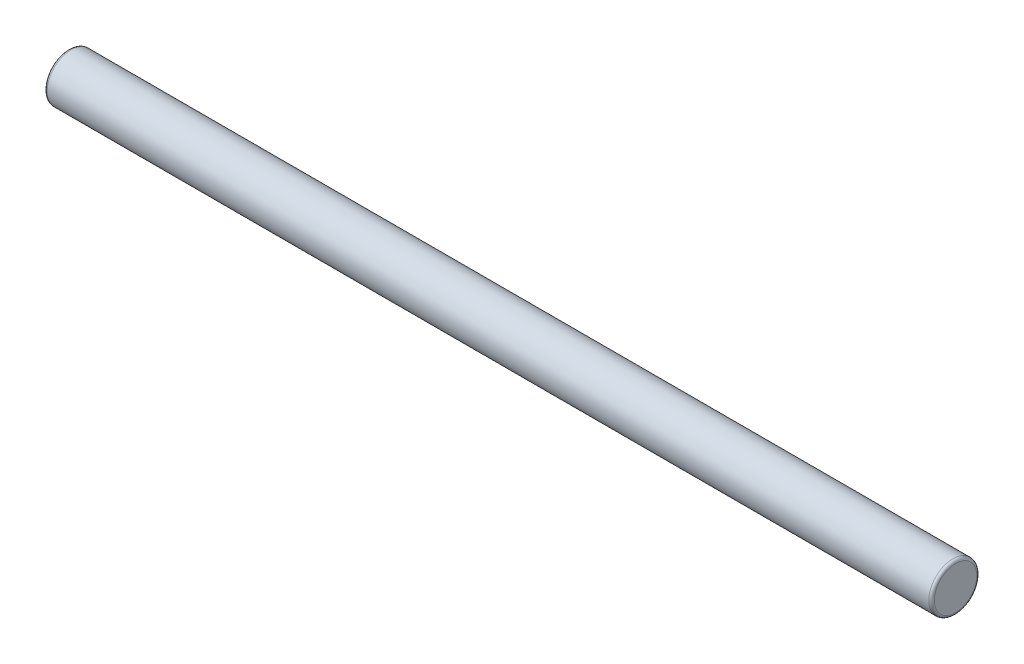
ISO-10303-21;
HEADER;
FILE_DESCRIPTION(('STEP AP214'),'2;1');
FILE_NAME('part.step','',(''),(''),'','','');
FILE_SCHEMA(('AUTOMOTIVE_DESIGN { 1 0 10303 214 1 1 1 1 }'));
ENDSEC;
DATA;
#1=APPLICATION_CONTEXT('core data for automotive mechanical design processes');
#2=APPLICATION_PROTOCOL_DEFINITION('international standard','automotive_design',2000,#1);
#3=PRODUCT_CONTEXT('',#1,'mechanical');
#4=PRODUCT('Part','Part','',(#3));
#5=PRODUCT_RELATED_PRODUCT_CATEGORY('part','',(#4));
#6=PRODUCT_DEFINITION_FORMATION('','',#4);
#7=PRODUCT_DEFINITION_CONTEXT('part definition',#1,'design');
#8=PRODUCT_DEFINITION('design','',#6,#7);
#9=PRODUCT_DEFINITION_SHAPE('','',#8);
#10=(LENGTH_UNIT() NAMED_UNIT(*) SI_UNIT(.MILLI.,.METRE.));
#11=(NAMED_UNIT(*) PLANE_ANGLE_UNIT() SI_UNIT($,.RADIAN.));
#12=(NAMED_UNIT(*) SI_UNIT($,.STERADIAN.) SOLID_ANGLE_UNIT());
#13=UNCERTAINTY_MEASURE_WITH_UNIT(LENGTH_MEASURE(1.E-05),#10,'distance_accuracy_value','');
#14=(GEOMETRIC_REPRESENTATION_CONTEXT(3) GLOBAL_UNCERTAINTY_ASSIGNED_CONTEXT((#13)) GLOBAL_UNIT_ASSIGNED_CONTEXT((#10,
#11,#12)) REPRESENTATION_CONTEXT('',''));
#15=CARTESIAN_POINT('',(0.,0.,0.));
#16=DIRECTION('',(0.,0.,1.));
#17=DIRECTION('',(1.,0.,0.));
#18=AXIS2_PLACEMENT_3D('',#15,#16,#17);
#19=CARTESIAN_POINT('',(-323.,0.,0.));
#20=DIRECTION('',(1.,0.,0.));
#21=DIRECTION('',(0.,1.,0.));
#22=AXIS2_PLACEMENT_3D('',#19,#20,#21);
#23=PLANE('',#22);
#24=CARTESIAN_POINT('',(-323.,0.,0.));
#25=DIRECTION('',(1.,0.,0.));
#26=DIRECTION('',(0.,1.,0.));
#27=AXIS2_PLACEMENT_3D('',#24,#25,#26);
#28=CIRCLE('',#27,15.5);
#29=CARTESIAN_POINT('',(-323.,15.5,0.));
#30=VERTEX_POINT('',#29);
#31=EDGE_CURVE('E55',#30,#30,#28,.F.);
#32=ORIENTED_EDGE('',*,*,#31,.T.);
#33=EDGE_LOOP('',(#32));
#34=FACE_BOUND('',#33,.T.);
#35=ADVANCED_FACE('F37',(#34),#23,.F.);
#36=CARTESIAN_POINT('',(-323.,0.,0.));
#37=DIRECTION('',(-1.,0.,0.));
#38=DIRECTION('',(0.,-1.,0.));
#39=AXIS2_PLACEMENT_3D('',#36,#37,#38);
#40=CYLINDRICAL_SURFACE('',#39,17.5);
#41=CARTESIAN_POINT('',(-321.,0.,0.));
#42=DIRECTION('',(1.,0.,0.));
#43=DIRECTION('',(0.,1.,0.));
#44=AXIS2_PLACEMENT_3D('',#41,#42,#43);
#45=CIRCLE('',#44,17.5);
#46=CARTESIAN_POINT('',(-321.,17.5,0.));
#47=VERTEX_POINT('',#46);
#48=EDGE_CURVE('E45',#47,#47,#45,.T.);
#49=ORIENTED_EDGE('',*,*,#48,.T.);
#50=EDGE_LOOP('',(#49));
#51=FACE_BOUND('',#50,.T.);
#52=CARTESIAN_POINT('',(321.,1.18300880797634E-13,0.));
#53=DIRECTION('',(-1.,0.,0.));
#54=DIRECTION('',(0.,-1.,0.));
#55=AXIS2_PLACEMENT_3D('',#52,#53,#54);
#56=CIRCLE('',#55,17.5);
#57=CARTESIAN_POINT('',(321.,-17.4999999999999,0.));
#58=VERTEX_POINT('',#57);
#59=EDGE_CURVE('E50',#58,#58,#56,.T.);
#60=ORIENTED_EDGE('',*,*,#59,.T.);
#61=EDGE_LOOP('',(#60));
#62=FACE_BOUND('',#61,.T.);
#63=ADVANCED_FACE('F72',(#51,#62),#40,.T.);
#64=CARTESIAN_POINT('',(323.,17.5000000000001,0.));
#65=DIRECTION('',(-1.,0.,0.));
#66=DIRECTION('',(0.,-1.,0.));
#67=AXIS2_PLACEMENT_3D('',#64,#65,#66);
#68=PLANE('',#67);
#69=CARTESIAN_POINT('',(323.,1.18668274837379E-13,0.));
#70=DIRECTION('',(-1.,0.,0.));
#71=DIRECTION('',(0.,-1.,0.));
#72=AXIS2_PLACEMENT_3D('',#69,#70,#71);
#73=CIRCLE('',#72,15.5);
#74=CARTESIAN_POINT('',(323.,-15.4999999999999,0.));
#75=VERTEX_POINT('',#74);
#76=EDGE_CURVE('E10',#75,#75,#73,.F.);
#77=ORIENTED_EDGE('',*,*,#76,.T.);
#78=EDGE_LOOP('',(#77));
#79=FACE_BOUND('',#78,.T.);
#80=ADVANCED_FACE('F65',(#79),#68,.F.);
#81=CARTESIAN_POINT('',(-321.,0.,0.));
#82=DIRECTION('',(1.,0.,0.));
#83=DIRECTION('',(0.,1.,0.));
#84=AXIS2_PLACEMENT_3D('',#81,#82,#83);
#85=TOROIDAL_SURFACE('',#84,15.5,2.);
#86=ORIENTED_EDGE('',*,*,#48,.F.);
#87=EDGE_LOOP('',(#86));
#88=FACE_BOUND('',#87,.T.);
#89=ORIENTED_EDGE('',*,*,#31,.F.);
#90=EDGE_LOOP('',(#89));
#91=FACE_BOUND('',#90,.T.);
#92=ADVANCED_FACE('F63',(#88,#91),#85,.T.);
#93=CARTESIAN_POINT('',(321.,1.18300880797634E-13,0.));
#94=DIRECTION('',(-1.,0.,0.));
#95=DIRECTION('',(0.,-1.,0.));
#96=AXIS2_PLACEMENT_3D('',#93,#94,#95);
#97=TOROIDAL_SURFACE('',#96,15.5,2.);
#98=ORIENTED_EDGE('',*,*,#76,.F.);
#99=EDGE_LOOP('',(#98));
#100=FACE_BOUND('',#99,.T.);
#101=ORIENTED_EDGE('',*,*,#59,.F.);
#102=EDGE_LOOP('',(#101));
#103=FACE_BOUND('',#102,.T.);
#104=ADVANCED_FACE('F39',(#100,#103),#97,.T.);
#105=CLOSED_SHELL('',(#35,#63,#80,#92,#104));
#106=MANIFOLD_SOLID_BREP('B2',#105);
#107=ADVANCED_BREP_SHAPE_REPRESENTATION('',(#18,#106),#14);
#108=SHAPE_DEFINITION_REPRESENTATION(#9,#107);
ENDSEC;
END-ISO-10303-21;
